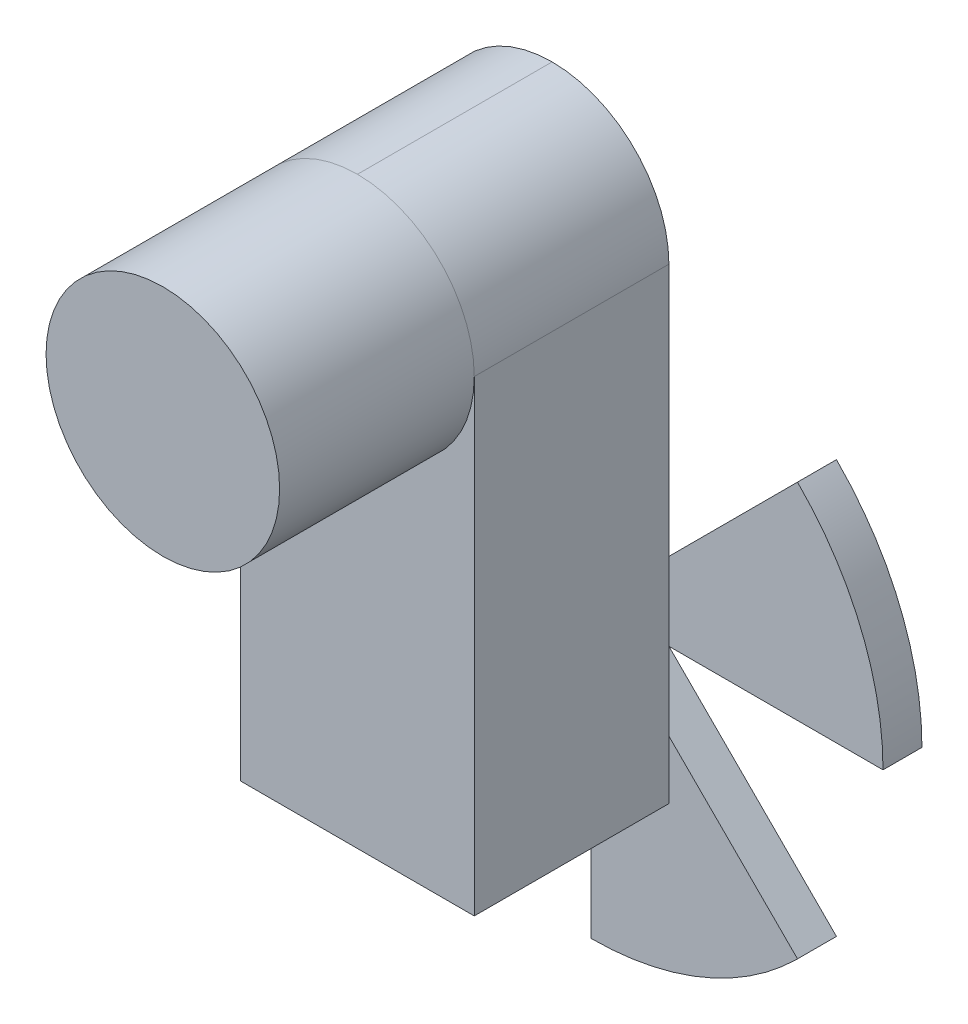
ISO-10303-21;
HEADER;
FILE_DESCRIPTION(('STEP AP214'),'2;1');
FILE_NAME('part.step','',(''),(''),'','','');
FILE_SCHEMA(('AUTOMOTIVE_DESIGN { 1 0 10303 214 1 1 1 1 }'));
ENDSEC;
DATA;
#1=APPLICATION_CONTEXT('core data for automotive mechanical design processes');
#2=APPLICATION_PROTOCOL_DEFINITION('international standard','automotive_design',2000,#1);
#3=PRODUCT_CONTEXT('',#1,'mechanical');
#4=PRODUCT('Part','Part','',(#3));
#5=PRODUCT_RELATED_PRODUCT_CATEGORY('part','',(#4));
#6=PRODUCT_DEFINITION_FORMATION('','',#4);
#7=PRODUCT_DEFINITION_CONTEXT('part definition',#1,'design');
#8=PRODUCT_DEFINITION('design','',#6,#7);
#9=PRODUCT_DEFINITION_SHAPE('','',#8);
#10=(LENGTH_UNIT() NAMED_UNIT(*) SI_UNIT(.MILLI.,.METRE.));
#11=(NAMED_UNIT(*) PLANE_ANGLE_UNIT() SI_UNIT($,.RADIAN.));
#12=(NAMED_UNIT(*) SI_UNIT($,.STERADIAN.) SOLID_ANGLE_UNIT());
#13=UNCERTAINTY_MEASURE_WITH_UNIT(LENGTH_MEASURE(1.E-05),#10,'distance_accuracy_value','');
#14=(GEOMETRIC_REPRESENTATION_CONTEXT(3) GLOBAL_UNCERTAINTY_ASSIGNED_CONTEXT((#13)) GLOBAL_UNIT_ASSIGNED_CONTEXT((#10,
#11,#12)) REPRESENTATION_CONTEXT('',''));
#15=CARTESIAN_POINT('',(0.,0.,0.));
#16=DIRECTION('',(0.,0.,1.));
#17=DIRECTION('',(1.,0.,0.));
#18=AXIS2_PLACEMENT_3D('',#15,#16,#17);
#19=CARTESIAN_POINT('',(0.,-24.13,-30.48));
#20=DIRECTION('',(0.,0.,1.));
#21=DIRECTION('',(1.,0.,0.));
#22=AXIS2_PLACEMENT_3D('',#19,#20,#21);
#23=CYLINDRICAL_SURFACE('',#22,19.05);
#24=DIRECTION('',(0.,0.,-1.));
#25=VECTOR('',#24,1.);
#26=CARTESIAN_POINT('',(13.4703841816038,-37.6003841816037,-27.94));
#27=LINE('',#26,#25);
#28=CARTESIAN_POINT('',(13.4703841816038,-37.6003841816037,-27.94));
#29=VERTEX_POINT('',#28);
#30=CARTESIAN_POINT('',(13.4703841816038,-37.6003841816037,-30.48));
#31=VERTEX_POINT('',#30);
#32=EDGE_CURVE('E207',#29,#31,#27,.T.);
#33=ORIENTED_EDGE('',*,*,#32,.F.);
#34=CARTESIAN_POINT('',(0.,-24.13,-27.94));
#35=DIRECTION('',(0.,0.,1.));
#36=DIRECTION('',(1.,0.,0.));
#37=AXIS2_PLACEMENT_3D('',#34,#35,#36);
#38=CIRCLE('',#37,19.05);
#39=CARTESIAN_POINT('',(0.,-43.18,-27.94));
#40=VERTEX_POINT('',#39);
#41=EDGE_CURVE('E199',#40,#29,#38,.T.);
#42=ORIENTED_EDGE('',*,*,#41,.F.);
#43=DIRECTION('',(0.,0.,-1.));
#44=VECTOR('',#43,1.);
#45=CARTESIAN_POINT('',(0.,-43.18,-27.94));
#46=LINE('',#45,#44);
#47=CARTESIAN_POINT('',(0.,-43.18,-30.48));
#48=VERTEX_POINT('',#47);
#49=EDGE_CURVE('E182',#40,#48,#46,.T.);
#50=ORIENTED_EDGE('',*,*,#49,.T.);
#51=CARTESIAN_POINT('',(0.,-24.13,-30.48));
#52=DIRECTION('',(0.,0.,1.));
#53=DIRECTION('',(1.,0.,0.));
#54=AXIS2_PLACEMENT_3D('',#51,#52,#53);
#55=CIRCLE('',#54,19.05);
#56=EDGE_CURVE('E327',#48,#31,#55,.T.);
#57=ORIENTED_EDGE('',*,*,#56,.T.);
#58=EDGE_LOOP('',(#33,#42,#50,#57));
#59=FACE_BOUND('',#58,.T.);
#60=ADVANCED_FACE('F39',(#59),#23,.T.);
#61=DIRECTION('',(0.,0.,-1.));
#62=VECTOR('',#61,1.);
#63=CARTESIAN_POINT('',(-13.4703841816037,-37.6003841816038,-27.94));
#64=LINE('',#63,#62);
#65=CARTESIAN_POINT('',(-13.4703841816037,-37.6003841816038,-27.94));
#66=VERTEX_POINT('',#65);
#67=CARTESIAN_POINT('',(-13.4703841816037,-37.6003841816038,-30.48));
#68=VERTEX_POINT('',#67);
#69=EDGE_CURVE('E191',#66,#68,#64,.T.);
#70=ORIENTED_EDGE('',*,*,#69,.F.);
#71=CARTESIAN_POINT('',(-19.05,-24.1299999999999,-27.94));
#72=VERTEX_POINT('',#71);
#73=EDGE_CURVE('E209',#72,#66,#38,.T.);
#74=ORIENTED_EDGE('',*,*,#73,.F.);
#75=DIRECTION('',(0.,0.,-1.));
#76=VECTOR('',#75,1.);
#77=CARTESIAN_POINT('',(-19.05,-24.1299999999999,-27.94));
#78=LINE('',#77,#76);
#79=CARTESIAN_POINT('',(-19.05,-24.1299999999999,-30.48));
#80=VERTEX_POINT('',#79);
#81=EDGE_CURVE('E378',#72,#80,#78,.T.);
#82=ORIENTED_EDGE('',*,*,#81,.T.);
#83=EDGE_CURVE('E324',#80,#68,#55,.T.);
#84=ORIENTED_EDGE('',*,*,#83,.T.);
#85=EDGE_LOOP('',(#70,#74,#82,#84));
#86=FACE_BOUND('',#85,.T.);
#87=ADVANCED_FACE('F462',(#86),#23,.T.);
#88=CARTESIAN_POINT('',(0.,-5.08,-30.48));
#89=VERTEX_POINT('',#88);
#90=CARTESIAN_POINT('',(-13.4703841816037,-10.6596158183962,-30.48));
#91=VERTEX_POINT('',#90);
#92=EDGE_CURVE('E222',#89,#91,#55,.T.);
#93=ORIENTED_EDGE('',*,*,#92,.T.);
#94=DIRECTION('',(0.,0.,-1.));
#95=VECTOR('',#94,1.);
#96=CARTESIAN_POINT('',(-13.4703841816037,-10.6596158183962,-27.94));
#97=LINE('',#96,#95);
#98=CARTESIAN_POINT('',(-13.4703841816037,-10.6596158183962,-27.94));
#99=VERTEX_POINT('',#98);
#100=EDGE_CURVE('E383',#99,#91,#97,.T.);
#101=ORIENTED_EDGE('',*,*,#100,.F.);
#102=CARTESIAN_POINT('',(0.,-5.08,-27.94));
#103=VERTEX_POINT('',#102);
#104=EDGE_CURVE('E215',#103,#99,#38,.T.);
#105=ORIENTED_EDGE('',*,*,#104,.F.);
#106=DIRECTION('',(0.,0.,-1.));
#107=VECTOR('',#106,1.);
#108=CARTESIAN_POINT('',(0.,-5.08,51.2713898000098));
#109=LINE('',#108,#107);
#110=EDGE_CURVE('E358',#103,#89,#109,.T.);
#111=ORIENTED_EDGE('',*,*,#110,.T.);
#112=EDGE_LOOP('',(#93,#101,#105,#111));
#113=FACE_BOUND('',#112,.T.);
#114=ADVANCED_FACE('F485',(#113),#23,.T.);
#115=CARTESIAN_POINT('',(0.,-24.13,-30.48));
#116=DIRECTION('',(0.,0.,-1.));
#117=DIRECTION('',(1.,0.,0.));
#118=AXIS2_PLACEMENT_3D('',#115,#116,#117);
#119=PLANE('',#118);
#120=DIRECTION('',(-0.70710678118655,0.707106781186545,0.));
#121=VECTOR('',#120,1.);
#122=CARTESIAN_POINT('',(-12.065,-12.0650000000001,-30.48));
#123=LINE('',#122,#121);
#124=CARTESIAN_POINT('',(1.79605122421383,-25.9260512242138,-30.48));
#125=VERTEX_POINT('',#124);
#126=EDGE_CURVE('E418',#31,#125,#123,.T.);
#127=ORIENTED_EDGE('',*,*,#126,.F.);
#128=ORIENTED_EDGE('',*,*,#56,.F.);
#129=DIRECTION('',(0.,-1.,0.));
#130=VECTOR('',#129,1.);
#131=CARTESIAN_POINT('',(0.,0.,-30.48));
#132=LINE('',#131,#130);
#133=CARTESIAN_POINT('',(0.,-26.67,-30.48));
#134=VERTEX_POINT('',#133);
#135=EDGE_CURVE('E185',#134,#48,#132,.T.);
#136=ORIENTED_EDGE('',*,*,#135,.F.);
#137=CARTESIAN_POINT('',(0.,-24.13,-30.48));
#138=DIRECTION('',(0.,0.,1.));
#139=DIRECTION('',(1.,0.,0.));
#140=AXIS2_PLACEMENT_3D('',#137,#138,#139);
#141=CIRCLE('',#140,2.54);
#142=CARTESIAN_POINT('',(-1.79605122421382,-25.9260512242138,-30.48));
#143=VERTEX_POINT('',#142);
#144=EDGE_CURVE('E417',#143,#134,#141,.T.);
#145=ORIENTED_EDGE('',*,*,#144,.F.);
#146=DIRECTION('',(0.707106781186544,0.707106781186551,0.));
#147=VECTOR('',#146,1.);
#148=CARTESIAN_POINT('',(12.065,-12.0649999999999,-30.48));
#149=LINE('',#148,#147);
#150=EDGE_CURVE('E204',#68,#143,#149,.T.);
#151=ORIENTED_EDGE('',*,*,#150,.F.);
#152=ORIENTED_EDGE('',*,*,#83,.F.);
#153=DIRECTION('',(-1.,0.,0.));
#154=VECTOR('',#153,1.);
#155=CARTESIAN_POINT('',(0.,-24.13,-30.48));
#156=LINE('',#155,#154);
#157=CARTESIAN_POINT('',(-2.54,-24.13,-30.48));
#158=VERTEX_POINT('',#157);
#159=EDGE_CURVE('E393',#158,#80,#156,.T.);
#160=ORIENTED_EDGE('',*,*,#159,.F.);
#161=CARTESIAN_POINT('',(0.,-24.13,-30.48));
#162=DIRECTION('',(0.,0.,1.));
#163=DIRECTION('',(1.,0.,0.));
#164=AXIS2_PLACEMENT_3D('',#161,#162,#163);
#165=CIRCLE('',#164,2.54);
#166=CARTESIAN_POINT('',(-1.79605122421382,-22.3339487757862,-30.48));
#167=VERTEX_POINT('',#166);
#168=EDGE_CURVE('E396',#167,#158,#165,.T.);
#169=ORIENTED_EDGE('',*,*,#168,.F.);
#170=DIRECTION('',(-0.707106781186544,0.707106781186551,0.));
#171=VECTOR('',#170,1.);
#172=CARTESIAN_POINT('',(-12.065,-12.0649999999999,-30.48));
#173=LINE('',#172,#171);
#174=EDGE_CURVE('E388',#167,#91,#173,.T.);
#175=ORIENTED_EDGE('',*,*,#174,.T.);
#176=ORIENTED_EDGE('',*,*,#92,.F.);
#177=DIRECTION('',(0.,-1.,0.));
#178=VECTOR('',#177,1.);
#179=CARTESIAN_POINT('',(0.,-24.13,-30.48));
#180=LINE('',#179,#178);
#181=CARTESIAN_POINT('',(0.,-21.59,-30.48));
#182=VERTEX_POINT('',#181);
#183=EDGE_CURVE('E351',#89,#182,#180,.T.);
#184=ORIENTED_EDGE('',*,*,#183,.T.);
#185=CARTESIAN_POINT('',(0.,-24.13,-30.48));
#186=DIRECTION('',(0.,0.,-1.));
#187=DIRECTION('',(-1.,0.,0.));
#188=AXIS2_PLACEMENT_3D('',#185,#186,#187);
#189=CIRCLE('',#188,2.54);
#190=CARTESIAN_POINT('',(1.79605122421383,-22.3339487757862,-30.48));
#191=VERTEX_POINT('',#190);
#192=EDGE_CURVE('E347',#191,#182,#189,.F.);
#193=ORIENTED_EDGE('',*,*,#192,.F.);
#194=DIRECTION('',(0.707106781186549,0.707106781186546,0.));
#195=VECTOR('',#194,1.);
#196=CARTESIAN_POINT('',(0.,-24.13,-30.48));
#197=LINE('',#196,#195);
#198=CARTESIAN_POINT('',(13.4703841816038,-10.6596158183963,-30.48));
#199=VERTEX_POINT('',#198);
#200=EDGE_CURVE('E343',#191,#199,#197,.T.);
#201=ORIENTED_EDGE('',*,*,#200,.T.);
#202=CARTESIAN_POINT('',(19.05,-24.13,-30.48));
#203=VERTEX_POINT('',#202);
#204=EDGE_CURVE('E221',#203,#199,#55,.T.);
#205=ORIENTED_EDGE('',*,*,#204,.F.);
#206=DIRECTION('',(1.,0.,0.));
#207=VECTOR('',#206,1.);
#208=CARTESIAN_POINT('',(0.,-24.13,-30.48));
#209=LINE('',#208,#207);
#210=CARTESIAN_POINT('',(2.54,-24.13,-30.48));
#211=VERTEX_POINT('',#210);
#212=EDGE_CURVE('E422',#211,#203,#209,.T.);
#213=ORIENTED_EDGE('',*,*,#212,.F.);
#214=CARTESIAN_POINT('',(0.,-24.13,-30.48));
#215=DIRECTION('',(0.,0.,1.));
#216=DIRECTION('',(1.,0.,0.));
#217=AXIS2_PLACEMENT_3D('',#214,#215,#216);
#218=CIRCLE('',#217,2.54);
#219=EDGE_CURVE('E425',#125,#211,#218,.T.);
#220=ORIENTED_EDGE('',*,*,#219,.F.);
#221=EDGE_LOOP('',(#127,#128,#136,#145,#151,#152,#160,#169,#175,#176,#184,#193,#201,#205,#213,#220));
#222=FACE_BOUND('',#221,.T.);
#223=ADVANCED_FACE('F345',(#222),#119,.T.);
#224=CARTESIAN_POINT('',(0.,-24.13,-27.94));
#225=DIRECTION('',(0.,0.,-1.));
#226=DIRECTION('',(1.,0.,0.));
#227=AXIS2_PLACEMENT_3D('',#224,#225,#226);
#228=PLANE('',#227);
#229=ORIENTED_EDGE('',*,*,#41,.T.);
#230=DIRECTION('',(-0.70710678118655,0.707106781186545,0.));
#231=VECTOR('',#230,1.);
#232=CARTESIAN_POINT('',(-12.065,-12.0650000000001,-27.94));
#233=LINE('',#232,#231);
#234=CARTESIAN_POINT('',(1.79605122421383,-25.9260512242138,-27.94));
#235=VERTEX_POINT('',#234);
#236=EDGE_CURVE('E409',#29,#235,#233,.T.);
#237=ORIENTED_EDGE('',*,*,#236,.T.);
#238=CARTESIAN_POINT('',(0.,-24.13,-27.94));
#239=DIRECTION('',(0.,0.,1.));
#240=DIRECTION('',(1.,0.,0.));
#241=AXIS2_PLACEMENT_3D('',#238,#239,#240);
#242=CIRCLE('',#241,2.54);
#243=CARTESIAN_POINT('',(0.,-26.67,-27.94));
#244=VERTEX_POINT('',#243);
#245=EDGE_CURVE('E201',#244,#235,#242,.T.);
#246=ORIENTED_EDGE('',*,*,#245,.F.);
#247=DIRECTION('',(0.,-1.,0.));
#248=VECTOR('',#247,1.);
#249=CARTESIAN_POINT('',(0.,0.,-27.94));
#250=LINE('',#249,#248);
#251=EDGE_CURVE('E64',#244,#40,#250,.T.);
#252=ORIENTED_EDGE('',*,*,#251,.T.);
#253=EDGE_LOOP('',(#229,#237,#246,#252));
#254=FACE_BOUND('',#253,.T.);
#255=ADVANCED_FACE('F197',(#254),#228,.F.);
#256=ORIENTED_EDGE('',*,*,#73,.T.);
#257=DIRECTION('',(0.707106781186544,0.707106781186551,0.));
#258=VECTOR('',#257,1.);
#259=CARTESIAN_POINT('',(12.065,-12.0649999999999,-27.94));
#260=LINE('',#259,#258);
#261=CARTESIAN_POINT('',(-1.79605122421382,-25.9260512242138,-27.94));
#262=VERTEX_POINT('',#261);
#263=EDGE_CURVE('E203',#66,#262,#260,.T.);
#264=ORIENTED_EDGE('',*,*,#263,.T.);
#265=CARTESIAN_POINT('',(-2.54,-24.13,-27.94));
#266=VERTEX_POINT('',#265);
#267=EDGE_CURVE('E229',#266,#262,#242,.T.);
#268=ORIENTED_EDGE('',*,*,#267,.F.);
#269=DIRECTION('',(-1.,0.,0.));
#270=VECTOR('',#269,1.);
#271=CARTESIAN_POINT('',(0.,-24.13,-27.94));
#272=LINE('',#271,#270);
#273=EDGE_CURVE('E392',#266,#72,#272,.T.);
#274=ORIENTED_EDGE('',*,*,#273,.T.);
#275=EDGE_LOOP('',(#256,#264,#268,#274));
#276=FACE_BOUND('',#275,.T.);
#277=ADVANCED_FACE('F451',(#276),#228,.F.);
#278=DIRECTION('',(-0.707106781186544,0.707106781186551,0.));
#279=VECTOR('',#278,1.);
#280=CARTESIAN_POINT('',(-12.065,-12.0649999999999,-27.94));
#281=LINE('',#280,#279);
#282=CARTESIAN_POINT('',(-1.79605122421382,-22.3339487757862,-27.94));
#283=VERTEX_POINT('',#282);
#284=EDGE_CURVE('E379',#283,#99,#281,.T.);
#285=ORIENTED_EDGE('',*,*,#284,.F.);
#286=CARTESIAN_POINT('',(0.,-21.59,-27.94));
#287=VERTEX_POINT('',#286);
#288=EDGE_CURVE('E224',#287,#283,#242,.T.);
#289=ORIENTED_EDGE('',*,*,#288,.F.);
#290=DIRECTION('',(0.,-1.,0.));
#291=VECTOR('',#290,1.);
#292=CARTESIAN_POINT('',(0.,-24.13,-27.94));
#293=LINE('',#292,#291);
#294=EDGE_CURVE('E11',#103,#287,#293,.T.);
#295=ORIENTED_EDGE('',*,*,#294,.F.);
#296=ORIENTED_EDGE('',*,*,#104,.T.);
#297=EDGE_LOOP('',(#285,#289,#295,#296));
#298=FACE_BOUND('',#297,.T.);
#299=ADVANCED_FACE('F476',(#298),#228,.F.);
#300=DIRECTION('',(0.,0.,-1.));
#301=VECTOR('',#300,1.);
#302=CARTESIAN_POINT('',(19.05,-24.13,-27.94));
#303=LINE('',#302,#301);
#304=CARTESIAN_POINT('',(19.05,-24.13,-27.94));
#305=VERTEX_POINT('',#304);
#306=EDGE_CURVE('E338',#305,#203,#303,.T.);
#307=ORIENTED_EDGE('',*,*,#306,.T.);
#308=ORIENTED_EDGE('',*,*,#204,.T.);
#309=DIRECTION('',(0.,0.,-1.));
#310=VECTOR('',#309,1.);
#311=CARTESIAN_POINT('',(13.4703841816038,-10.6596158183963,51.2713898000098));
#312=LINE('',#311,#310);
#313=CARTESIAN_POINT('',(13.4703841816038,-10.6596158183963,-27.94));
#314=VERTEX_POINT('',#313);
#315=EDGE_CURVE('E337',#314,#199,#312,.T.);
#316=ORIENTED_EDGE('',*,*,#315,.F.);
#317=EDGE_CURVE('E210',#305,#314,#38,.T.);
#318=ORIENTED_EDGE('',*,*,#317,.F.);
#319=EDGE_LOOP('',(#307,#308,#316,#318));
#320=FACE_BOUND('',#319,.T.);
#321=ADVANCED_FACE('F334',(#320),#23,.T.);
#322=CARTESIAN_POINT('',(2.54,-24.13,-27.94));
#323=VERTEX_POINT('',#322);
#324=CARTESIAN_POINT('',(1.79605122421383,-22.3339487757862,-27.94));
#325=VERTEX_POINT('',#324);
#326=EDGE_CURVE('E230',#323,#325,#242,.T.);
#327=ORIENTED_EDGE('',*,*,#326,.F.);
#328=DIRECTION('',(1.,0.,0.));
#329=VECTOR('',#328,1.);
#330=CARTESIAN_POINT('',(0.,-24.13,-27.94));
#331=LINE('',#330,#329);
#332=EDGE_CURVE('E56',#323,#305,#331,.T.);
#333=ORIENTED_EDGE('',*,*,#332,.T.);
#334=ORIENTED_EDGE('',*,*,#317,.T.);
#335=DIRECTION('',(-0.707106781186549,-0.707106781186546,0.));
#336=VECTOR('',#335,1.);
#337=CARTESIAN_POINT('',(0.,-24.13,-27.94));
#338=LINE('',#337,#336);
#339=EDGE_CURVE('E216',#314,#325,#338,.T.);
#340=ORIENTED_EDGE('',*,*,#339,.T.);
#341=EDGE_LOOP('',(#327,#333,#334,#340));
#342=FACE_BOUND('',#341,.T.);
#343=ADVANCED_FACE('F473',(#342),#228,.F.);
#344=CARTESIAN_POINT('',(0.,0.,12.7));
#345=DIRECTION('',(0.,0.,-1.));
#346=DIRECTION('',(-1.,0.,0.));
#347=AXIS2_PLACEMENT_3D('',#344,#345,#346);
#348=CYLINDRICAL_SURFACE('',#347,7.62);
#349=CARTESIAN_POINT('',(0.,0.,0.));
#350=DIRECTION('',(0.,0.,-1.));
#351=DIRECTION('',(-1.,0.,0.));
#352=AXIS2_PLACEMENT_3D('',#349,#350,#351);
#353=CIRCLE('',#352,7.62);
#354=CARTESIAN_POINT('',(-7.62,0.,0.));
#355=VERTEX_POINT('',#354);
#356=EDGE_CURVE('E43',#355,#355,#353,.T.);
#357=ORIENTED_EDGE('',*,*,#356,.T.);
#358=EDGE_LOOP('',(#357));
#359=FACE_BOUND('',#358,.T.);
#360=CARTESIAN_POINT('',(0.,0.,-12.7));
#361=DIRECTION('',(0.,0.,1.));
#362=DIRECTION('',(1.,0.,0.));
#363=AXIS2_PLACEMENT_3D('',#360,#361,#362);
#364=CIRCLE('',#363,7.62);
#365=CARTESIAN_POINT('',(7.61999999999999,0.,-12.7));
#366=VERTEX_POINT('',#365);
#367=CARTESIAN_POINT('',(0.,7.62,-12.7));
#368=VERTEX_POINT('',#367);
#369=EDGE_CURVE('E261',#366,#368,#364,.T.);
#370=ORIENTED_EDGE('',*,*,#369,.T.);
#371=CARTESIAN_POINT('',(-7.62,0.,-12.7));
#372=VERTEX_POINT('',#371);
#373=EDGE_CURVE('E265',#368,#372,#364,.T.);
#374=ORIENTED_EDGE('',*,*,#373,.T.);
#375=EDGE_CURVE('E260',#372,#366,#364,.T.);
#376=ORIENTED_EDGE('',*,*,#375,.T.);
#377=EDGE_LOOP('',(#370,#374,#376));
#378=FACE_BOUND('',#377,.T.);
#379=ADVANCED_FACE('F314',(#359,#378),#348,.T.);
#380=CARTESIAN_POINT('',(-7.62,7.62,-25.4));
#381=DIRECTION('',(-1.,0.,0.));
#382=DIRECTION('',(0.,-1.,0.));
#383=AXIS2_PLACEMENT_3D('',#380,#381,#382);
#384=PLANE('',#383);
#385=DIRECTION('',(0.,-1.,0.));
#386=VECTOR('',#385,1.);
#387=CARTESIAN_POINT('',(-7.62,7.62,-12.7));
#388=LINE('',#387,#386);
#389=CARTESIAN_POINT('',(-7.62,-30.48,-12.7));
#390=VERTEX_POINT('',#389);
#391=EDGE_CURVE('E244',#372,#390,#388,.T.);
#392=ORIENTED_EDGE('',*,*,#391,.F.);
#393=DIRECTION('',(0.,0.,1.));
#394=VECTOR('',#393,1.);
#395=CARTESIAN_POINT('',(-7.62,0.,-25.4));
#396=LINE('',#395,#394);
#397=CARTESIAN_POINT('',(-7.62,0.,-25.4));
#398=VERTEX_POINT('',#397);
#399=EDGE_CURVE('E275',#372,#398,#396,.F.);
#400=ORIENTED_EDGE('',*,*,#399,.T.);
#401=DIRECTION('',(0.,-1.,0.));
#402=VECTOR('',#401,1.);
#403=CARTESIAN_POINT('',(-7.62,7.62,-25.4));
#404=LINE('',#403,#402);
#405=CARTESIAN_POINT('',(-7.62,-30.48,-25.4));
#406=VERTEX_POINT('',#405);
#407=EDGE_CURVE('E231',#398,#406,#404,.T.);
#408=ORIENTED_EDGE('',*,*,#407,.T.);
#409=DIRECTION('',(0.,0.,1.));
#410=VECTOR('',#409,1.);
#411=CARTESIAN_POINT('',(-7.62,-30.48,-25.4));
#412=LINE('',#411,#410);
#413=EDGE_CURVE('E243',#406,#390,#412,.T.);
#414=ORIENTED_EDGE('',*,*,#413,.T.);
#415=EDGE_LOOP('',(#392,#400,#408,#414));
#416=FACE_BOUND('',#415,.T.);
#417=ADVANCED_FACE('F481',(#416),#384,.T.);
#418=CARTESIAN_POINT('',(7.61999999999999,7.62,-25.4));
#419=DIRECTION('',(1.,0.,0.));
#420=DIRECTION('',(0.,1.,0.));
#421=AXIS2_PLACEMENT_3D('',#418,#419,#420);
#422=PLANE('',#421);
#423=DIRECTION('',(0.,1.,0.));
#424=VECTOR('',#423,1.);
#425=CARTESIAN_POINT('',(7.61999999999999,7.62,-25.4));
#426=LINE('',#425,#424);
#427=CARTESIAN_POINT('',(7.62,-30.48,-25.4));
#428=VERTEX_POINT('',#427);
#429=CARTESIAN_POINT('',(7.61999999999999,0.,-25.4));
#430=VERTEX_POINT('',#429);
#431=EDGE_CURVE('E234',#428,#430,#426,.T.);
#432=ORIENTED_EDGE('',*,*,#431,.T.);
#433=DIRECTION('',(0.,0.,1.));
#434=VECTOR('',#433,1.);
#435=CARTESIAN_POINT('',(7.61999999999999,0.,-25.4));
#436=LINE('',#435,#434);
#437=EDGE_CURVE('E264',#430,#366,#436,.T.);
#438=ORIENTED_EDGE('',*,*,#437,.T.);
#439=DIRECTION('',(0.,1.,0.));
#440=VECTOR('',#439,1.);
#441=CARTESIAN_POINT('',(7.61999999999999,7.62,-12.7));
#442=LINE('',#441,#440);
#443=CARTESIAN_POINT('',(7.62,-30.48,-12.7));
#444=VERTEX_POINT('',#443);
#445=EDGE_CURVE('E247',#444,#366,#442,.T.);
#446=ORIENTED_EDGE('',*,*,#445,.F.);
#447=DIRECTION('',(0.,0.,1.));
#448=VECTOR('',#447,1.);
#449=CARTESIAN_POINT('',(7.62,-30.48,-25.4));
#450=LINE('',#449,#448);
#451=EDGE_CURVE('E257',#428,#444,#450,.T.);
#452=ORIENTED_EDGE('',*,*,#451,.F.);
#453=EDGE_LOOP('',(#432,#438,#446,#452));
#454=FACE_BOUND('',#453,.T.);
#455=ADVANCED_FACE('F308',(#454),#422,.T.);
#456=CARTESIAN_POINT('',(-7.62,-30.48,-25.4));
#457=DIRECTION('',(0.,-1.,0.));
#458=DIRECTION('',(1.,0.,0.));
#459=AXIS2_PLACEMENT_3D('',#456,#457,#458);
#460=PLANE('',#459);
#461=DIRECTION('',(1.,0.,0.));
#462=VECTOR('',#461,1.);
#463=CARTESIAN_POINT('',(-7.62,-30.48,-12.7));
#464=LINE('',#463,#462);
#465=EDGE_CURVE('E235',#390,#444,#464,.T.);
#466=ORIENTED_EDGE('',*,*,#465,.F.);
#467=ORIENTED_EDGE('',*,*,#413,.F.);
#468=DIRECTION('',(1.,0.,0.));
#469=VECTOR('',#468,1.);
#470=CARTESIAN_POINT('',(-7.62,-30.48,-25.4));
#471=LINE('',#470,#469);
#472=EDGE_CURVE('E239',#406,#428,#471,.T.);
#473=ORIENTED_EDGE('',*,*,#472,.T.);
#474=ORIENTED_EDGE('',*,*,#451,.T.);
#475=EDGE_LOOP('',(#466,#467,#473,#474));
#476=FACE_BOUND('',#475,.T.);
#477=ADVANCED_FACE('F291',(#476),#460,.T.);
#478=CARTESIAN_POINT('',(0.,0.,-25.4));
#479=DIRECTION('',(0.,0.,-1.));
#480=DIRECTION('',(1.,0.,0.));
#481=AXIS2_PLACEMENT_3D('',#478,#479,#480);
#482=PLANE('',#481);
#483=CARTESIAN_POINT('',(0.,-24.13,-25.4));
#484=DIRECTION('',(0.,0.,-1.));
#485=DIRECTION('',(-1.,0.,0.));
#486=AXIS2_PLACEMENT_3D('',#483,#484,#485);
#487=CIRCLE('',#486,2.54);
#488=CARTESIAN_POINT('',(-2.54,-24.13,-25.4));
#489=VERTEX_POINT('',#488);
#490=EDGE_CURVE('E49',#489,#489,#487,.T.);
#491=ORIENTED_EDGE('',*,*,#490,.F.);
#492=EDGE_LOOP('',(#491));
#493=FACE_BOUND('',#492,.T.);
#494=CARTESIAN_POINT('',(0.,0.,-25.4));
#495=DIRECTION('',(0.,0.,-1.));
#496=DIRECTION('',(-1.,0.,0.));
#497=AXIS2_PLACEMENT_3D('',#494,#495,#496);
#498=CIRCLE('',#497,7.62);
#499=CARTESIAN_POINT('',(0.,7.62,-25.4));
#500=VERTEX_POINT('',#499);
#501=EDGE_CURVE('E269',#398,#500,#498,.T.);
#502=ORIENTED_EDGE('',*,*,#501,.T.);
#503=CARTESIAN_POINT('',(0.,0.,-25.4));
#504=DIRECTION('',(0.,0.,-1.));
#505=DIRECTION('',(-1.,0.,0.));
#506=AXIS2_PLACEMENT_3D('',#503,#504,#505);
#507=CIRCLE('',#506,7.62);
#508=EDGE_CURVE('E272',#500,#430,#507,.T.);
#509=ORIENTED_EDGE('',*,*,#508,.T.);
#510=ORIENTED_EDGE('',*,*,#431,.F.);
#511=ORIENTED_EDGE('',*,*,#472,.F.);
#512=ORIENTED_EDGE('',*,*,#407,.F.);
#513=EDGE_LOOP('',(#502,#509,#510,#511,#512));
#514=FACE_BOUND('',#513,.T.);
#515=ADVANCED_FACE('F287',(#493,#514),#482,.T.);
#516=CARTESIAN_POINT('',(0.,0.,-12.7));
#517=DIRECTION('',(0.,0.,-1.));
#518=DIRECTION('',(1.,0.,0.));
#519=AXIS2_PLACEMENT_3D('',#516,#517,#518);
#520=PLANE('',#519);
#521=ORIENTED_EDGE('',*,*,#375,.F.);
#522=ORIENTED_EDGE('',*,*,#391,.T.);
#523=ORIENTED_EDGE('',*,*,#465,.T.);
#524=ORIENTED_EDGE('',*,*,#445,.T.);
#525=EDGE_LOOP('',(#521,#522,#523,#524));
#526=FACE_BOUND('',#525,.T.);
#527=ADVANCED_FACE('F290',(#526),#520,.F.);
#528=CARTESIAN_POINT('',(0.,0.,-25.4));
#529=DIRECTION('',(0.,0.,1.));
#530=DIRECTION('',(1.,0.,0.));
#531=AXIS2_PLACEMENT_3D('',#528,#529,#530);
#532=CYLINDRICAL_SURFACE('',#531,7.62);
#533=DIRECTION('',(0.,0.,1.));
#534=VECTOR('',#533,1.);
#535=CARTESIAN_POINT('',(0.,7.62,-25.4));
#536=LINE('',#535,#534);
#537=EDGE_CURVE('E228',#500,#368,#536,.T.);
#538=ORIENTED_EDGE('',*,*,#537,.F.);
#539=ORIENTED_EDGE('',*,*,#501,.F.);
#540=ORIENTED_EDGE('',*,*,#399,.F.);
#541=ORIENTED_EDGE('',*,*,#373,.F.);
#542=EDGE_LOOP('',(#538,#539,#540,#541));
#543=FACE_BOUND('',#542,.T.);
#544=ADVANCED_FACE('F41',(#543),#532,.T.);
#545=CARTESIAN_POINT('',(0.,0.,-25.4));
#546=DIRECTION('',(0.,0.,1.));
#547=DIRECTION('',(1.,0.,0.));
#548=AXIS2_PLACEMENT_3D('',#545,#546,#547);
#549=CYLINDRICAL_SURFACE('',#548,7.62);
#550=ORIENTED_EDGE('',*,*,#508,.F.);
#551=ORIENTED_EDGE('',*,*,#537,.T.);
#552=ORIENTED_EDGE('',*,*,#369,.F.);
#553=ORIENTED_EDGE('',*,*,#437,.F.);
#554=EDGE_LOOP('',(#550,#551,#552,#553));
#555=FACE_BOUND('',#554,.T.);
#556=ADVANCED_FACE('F305',(#555),#549,.T.);
#557=CARTESIAN_POINT('',(0.,-24.13,-27.94));
#558=DIRECTION('',(0.,0.,1.));
#559=DIRECTION('',(1.,0.,0.));
#560=AXIS2_PLACEMENT_3D('',#557,#558,#559);
#561=CYLINDRICAL_SURFACE('',#560,2.54);
#562=ORIENTED_EDGE('',*,*,#288,.T.);
#563=DIRECTION('',(0.,0.,-1.));
#564=VECTOR('',#563,1.);
#565=CARTESIAN_POINT('',(-1.79605122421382,-22.3339487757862,-27.94));
#566=LINE('',#565,#564);
#567=EDGE_CURVE('E374',#283,#167,#566,.T.);
#568=ORIENTED_EDGE('',*,*,#567,.T.);
#569=ORIENTED_EDGE('',*,*,#168,.T.);
#570=DIRECTION('',(0.,0.,-1.));
#571=VECTOR('',#570,1.);
#572=CARTESIAN_POINT('',(-2.54,-24.13,-27.94));
#573=LINE('',#572,#571);
#574=EDGE_CURVE('E375',#266,#158,#573,.T.);
#575=ORIENTED_EDGE('',*,*,#574,.F.);
#576=ORIENTED_EDGE('',*,*,#267,.T.);
#577=DIRECTION('',(0.,0.,-1.));
#578=VECTOR('',#577,1.);
#579=CARTESIAN_POINT('',(-1.79605122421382,-25.9260512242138,-27.94));
#580=LINE('',#579,#578);
#581=EDGE_CURVE('E400',#262,#143,#580,.T.);
#582=ORIENTED_EDGE('',*,*,#581,.T.);
#583=ORIENTED_EDGE('',*,*,#144,.T.);
#584=DIRECTION('',(0.,0.,-1.));
#585=VECTOR('',#584,1.);
#586=CARTESIAN_POINT('',(0.,-26.67,-27.94));
#587=LINE('',#586,#585);
#588=EDGE_CURVE('E192',#244,#134,#587,.T.);
#589=ORIENTED_EDGE('',*,*,#588,.F.);
#590=ORIENTED_EDGE('',*,*,#245,.T.);
#591=DIRECTION('',(0.,0.,-1.));
#592=VECTOR('',#591,1.);
#593=CARTESIAN_POINT('',(1.79605122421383,-25.9260512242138,-27.94));
#594=LINE('',#593,#592);
#595=EDGE_CURVE('E414',#235,#125,#594,.T.);
#596=ORIENTED_EDGE('',*,*,#595,.T.);
#597=ORIENTED_EDGE('',*,*,#219,.T.);
#598=DIRECTION('',(0.,0.,-1.));
#599=VECTOR('',#598,1.);
#600=CARTESIAN_POINT('',(2.54,-24.13,-27.94));
#601=LINE('',#600,#599);
#602=EDGE_CURVE('E406',#323,#211,#601,.T.);
#603=ORIENTED_EDGE('',*,*,#602,.F.);
#604=ORIENTED_EDGE('',*,*,#326,.T.);
#605=DIRECTION('',(0.,0.,1.));
#606=VECTOR('',#605,1.);
#607=CARTESIAN_POINT('',(1.79605122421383,-22.3339487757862,-93.5442048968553));
#608=LINE('',#607,#606);
#609=EDGE_CURVE('E369',#325,#191,#608,.F.);
#610=ORIENTED_EDGE('',*,*,#609,.T.);
#611=ORIENTED_EDGE('',*,*,#192,.T.);
#612=DIRECTION('',(0.,0.,1.));
#613=VECTOR('',#612,1.);
#614=CARTESIAN_POINT('',(0.,-21.59,-93.5442048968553));
#615=LINE('',#614,#613);
#616=EDGE_CURVE('E352',#182,#287,#615,.T.);
#617=ORIENTED_EDGE('',*,*,#616,.T.);
#618=EDGE_LOOP('',(#562,#568,#569,#575,#576,#582,#583,#589,#590,#596,#597,#603,#604,#610,#611,#617));
#619=FACE_BOUND('',#618,.T.);
#620=ORIENTED_EDGE('',*,*,#490,.T.);
#621=EDGE_LOOP('',(#620));
#622=FACE_BOUND('',#621,.T.);
#623=ADVANCED_FACE('F285',(#619,#622),#561,.T.);
#624=CARTESIAN_POINT('',(0.,-24.13,51.2713898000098));
#625=DIRECTION('',(1.,0.,0.));
#626=DIRECTION('',(0.,0.,-1.));
#627=AXIS2_PLACEMENT_3D('',#624,#625,#626);
#628=PLANE('',#627);
#629=ORIENTED_EDGE('',*,*,#616,.F.);
#630=ORIENTED_EDGE('',*,*,#183,.F.);
#631=ORIENTED_EDGE('',*,*,#110,.F.);
#632=ORIENTED_EDGE('',*,*,#294,.T.);
#633=EDGE_LOOP('',(#629,#630,#631,#632));
#634=FACE_BOUND('',#633,.T.);
#635=ADVANCED_FACE('F496',(#634),#628,.T.);
#636=CARTESIAN_POINT('',(0.,-24.13,51.2713898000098));
#637=DIRECTION('',(-0.707106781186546,0.707106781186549,0.));
#638=DIRECTION('',(-0.707106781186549,-0.707106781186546,0.));
#639=AXIS2_PLACEMENT_3D('',#636,#637,#638);
#640=PLANE('',#639);
#641=ORIENTED_EDGE('',*,*,#609,.F.);
#642=ORIENTED_EDGE('',*,*,#339,.F.);
#643=ORIENTED_EDGE('',*,*,#315,.T.);
#644=ORIENTED_EDGE('',*,*,#200,.F.);
#645=EDGE_LOOP('',(#641,#642,#643,#644));
#646=FACE_BOUND('',#645,.T.);
#647=ADVANCED_FACE('F355',(#646),#640,.T.);
#648=CARTESIAN_POINT('',(-12.065,-12.0649999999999,-27.94));
#649=DIRECTION('',(-0.707106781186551,-0.707106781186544,0.));
#650=DIRECTION('',(0.707106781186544,-0.707106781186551,0.));
#651=AXIS2_PLACEMENT_3D('',#648,#649,#650);
#652=PLANE('',#651);
#653=ORIENTED_EDGE('',*,*,#174,.F.);
#654=ORIENTED_EDGE('',*,*,#567,.F.);
#655=ORIENTED_EDGE('',*,*,#284,.T.);
#656=ORIENTED_EDGE('',*,*,#100,.T.);
#657=EDGE_LOOP('',(#653,#654,#655,#656));
#658=FACE_BOUND('',#657,.T.);
#659=ADVANCED_FACE('F580',(#658),#652,.T.);
#660=CARTESIAN_POINT('',(0.,-24.13,-27.94));
#661=DIRECTION('',(0.,-1.,0.));
#662=DIRECTION('',(1.,0.,0.));
#663=AXIS2_PLACEMENT_3D('',#660,#661,#662);
#664=PLANE('',#663);
#665=ORIENTED_EDGE('',*,*,#159,.T.);
#666=ORIENTED_EDGE('',*,*,#81,.F.);
#667=ORIENTED_EDGE('',*,*,#273,.F.);
#668=ORIENTED_EDGE('',*,*,#574,.T.);
#669=EDGE_LOOP('',(#665,#666,#667,#668));
#670=FACE_BOUND('',#669,.T.);
#671=ADVANCED_FACE('F460',(#670),#664,.F.);
#672=CARTESIAN_POINT('',(12.065,-12.0649999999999,-27.94));
#673=DIRECTION('',(-0.707106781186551,0.707106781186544,0.));
#674=DIRECTION('',(-0.707106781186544,-0.707106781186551,0.));
#675=AXIS2_PLACEMENT_3D('',#672,#673,#674);
#676=PLANE('',#675);
#677=ORIENTED_EDGE('',*,*,#150,.T.);
#678=ORIENTED_EDGE('',*,*,#581,.F.);
#679=ORIENTED_EDGE('',*,*,#263,.F.);
#680=ORIENTED_EDGE('',*,*,#69,.T.);
#681=EDGE_LOOP('',(#677,#678,#679,#680));
#682=FACE_BOUND('',#681,.T.);
#683=ADVANCED_FACE('F465',(#682),#676,.F.);
#684=CARTESIAN_POINT('',(0.,0.,-27.94));
#685=DIRECTION('',(1.,0.,0.));
#686=DIRECTION('',(0.,0.,-1.));
#687=AXIS2_PLACEMENT_3D('',#684,#685,#686);
#688=PLANE('',#687);
#689=ORIENTED_EDGE('',*,*,#135,.T.);
#690=ORIENTED_EDGE('',*,*,#49,.F.);
#691=ORIENTED_EDGE('',*,*,#251,.F.);
#692=ORIENTED_EDGE('',*,*,#588,.T.);
#693=EDGE_LOOP('',(#689,#690,#691,#692));
#694=FACE_BOUND('',#693,.T.);
#695=ADVANCED_FACE('F183',(#694),#688,.F.);
#696=CARTESIAN_POINT('',(-12.065,-12.0650000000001,-27.94));
#697=DIRECTION('',(-0.707106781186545,-0.70710678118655,0.));
#698=DIRECTION('',(0.70710678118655,-0.707106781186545,0.));
#699=AXIS2_PLACEMENT_3D('',#696,#697,#698);
#700=PLANE('',#699);
#701=ORIENTED_EDGE('',*,*,#126,.T.);
#702=ORIENTED_EDGE('',*,*,#595,.F.);
#703=ORIENTED_EDGE('',*,*,#236,.F.);
#704=ORIENTED_EDGE('',*,*,#32,.T.);
#705=EDGE_LOOP('',(#701,#702,#703,#704));
#706=FACE_BOUND('',#705,.T.);
#707=ADVANCED_FACE('F469',(#706),#700,.F.);
#708=CARTESIAN_POINT('',(0.,-24.13,-27.94));
#709=DIRECTION('',(0.,1.,0.));
#710=DIRECTION('',(-1.,0.,0.));
#711=AXIS2_PLACEMENT_3D('',#708,#709,#710);
#712=PLANE('',#711);
#713=ORIENTED_EDGE('',*,*,#212,.T.);
#714=ORIENTED_EDGE('',*,*,#306,.F.);
#715=ORIENTED_EDGE('',*,*,#332,.F.);
#716=ORIENTED_EDGE('',*,*,#602,.T.);
#717=EDGE_LOOP('',(#713,#714,#715,#716));
#718=FACE_BOUND('',#717,.T.);
#719=ADVANCED_FACE('F470',(#718),#712,.F.);
#720=CARTESIAN_POINT('',(19.05,18.5625094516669,0.));
#721=DIRECTION('',(0.,0.,-1.));
#722=DIRECTION('',(-1.,0.,0.));
#723=AXIS2_PLACEMENT_3D('',#720,#721,#722);
#724=PLANE('',#723);
#725=ORIENTED_EDGE('',*,*,#356,.F.);
#726=EDGE_LOOP('',(#725));
#727=FACE_BOUND('',#726,.T.);
#728=ADVANCED_FACE('F548',(#727),#724,.F.);
#729=CLOSED_SHELL('',(#60,#87,#114,#223,#255,#277,#299,#321,#343,#379,#417,#455,#477,#515,#527,
#544,#556,#623,#635,#647,#659,#671,#683,#695,#707,#719,#728));
#730=MANIFOLD_SOLID_BREP('B2',#729);
#731=ADVANCED_BREP_SHAPE_REPRESENTATION('',(#18,#730),#14);
#732=SHAPE_DEFINITION_REPRESENTATION(#9,#731);
ENDSEC;
END-ISO-10303-21;
